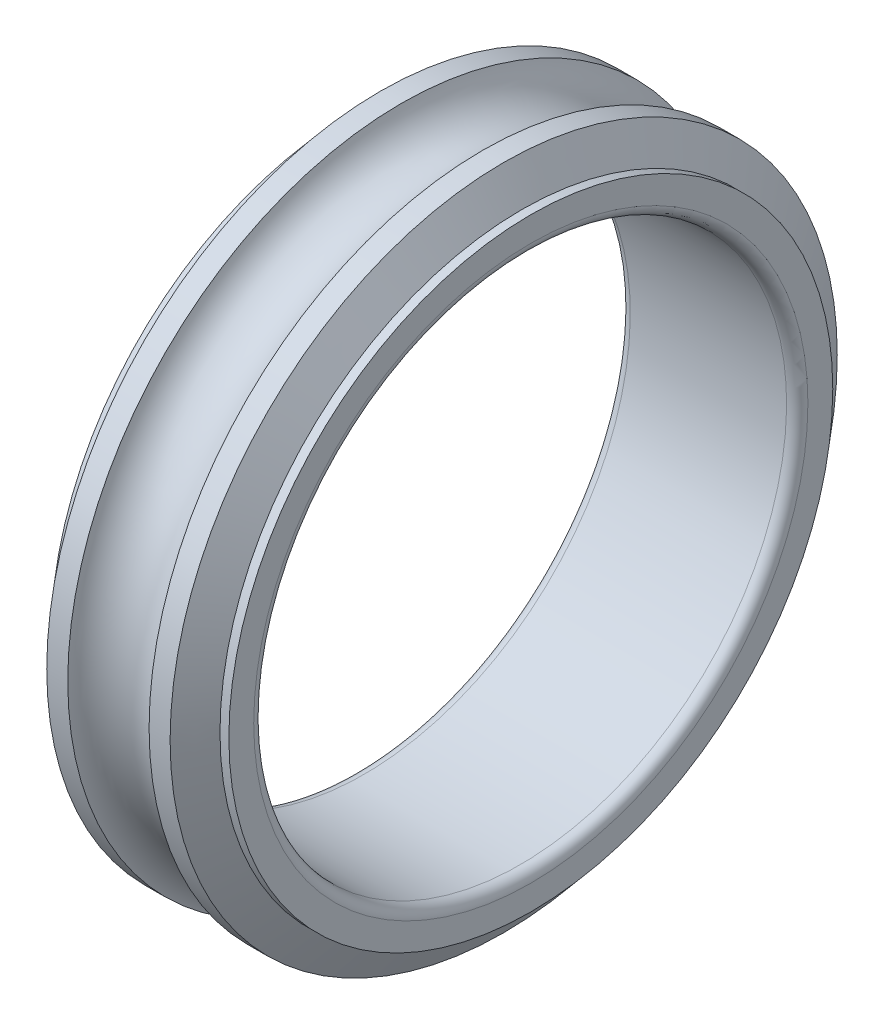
ISO-10303-21;
HEADER;
FILE_DESCRIPTION(('STEP AP214'),'2;1');
FILE_NAME('part.step','',(''),(''),'','','');
FILE_SCHEMA(('AUTOMOTIVE_DESIGN { 1 0 10303 214 1 1 1 1 }'));
ENDSEC;
DATA;
#1=APPLICATION_CONTEXT('core data for automotive mechanical design processes');
#2=APPLICATION_PROTOCOL_DEFINITION('international standard','automotive_design',2000,#1);
#3=PRODUCT_CONTEXT('',#1,'mechanical');
#4=PRODUCT('Part','Part','',(#3));
#5=PRODUCT_RELATED_PRODUCT_CATEGORY('part','',(#4));
#6=PRODUCT_DEFINITION_FORMATION('','',#4);
#7=PRODUCT_DEFINITION_CONTEXT('part definition',#1,'design');
#8=PRODUCT_DEFINITION('design','',#6,#7);
#9=PRODUCT_DEFINITION_SHAPE('','',#8);
#10=(LENGTH_UNIT() NAMED_UNIT(*) SI_UNIT(.MILLI.,.METRE.));
#11=(NAMED_UNIT(*) PLANE_ANGLE_UNIT() SI_UNIT($,.RADIAN.));
#12=(NAMED_UNIT(*) SI_UNIT($,.STERADIAN.) SOLID_ANGLE_UNIT());
#13=UNCERTAINTY_MEASURE_WITH_UNIT(LENGTH_MEASURE(1.E-05),#10,'distance_accuracy_value','');
#14=(GEOMETRIC_REPRESENTATION_CONTEXT(3) GLOBAL_UNCERTAINTY_ASSIGNED_CONTEXT((#13)) GLOBAL_UNIT_ASSIGNED_CONTEXT((#10,
#11,#12)) REPRESENTATION_CONTEXT('',''));
#15=CARTESIAN_POINT('',(0.,0.,0.));
#16=DIRECTION('',(0.,0.,1.));
#17=DIRECTION('',(1.,0.,0.));
#18=AXIS2_PLACEMENT_3D('',#15,#16,#17);
#19=CARTESIAN_POINT('',(2.5,0.,0.));
#20=DIRECTION('',(-1.,0.,0.));
#21=DIRECTION('',(0.,1.,0.));
#22=AXIS2_PLACEMENT_3D('',#19,#20,#21);
#23=CYLINDRICAL_SURFACE('',#22,7.5);
#24=CARTESIAN_POINT('',(4.7,0.,0.));
#25=DIRECTION('',(1.,0.,0.));
#26=DIRECTION('',(0.,1.,0.));
#27=AXIS2_PLACEMENT_3D('',#24,#25,#26);
#28=CIRCLE('',#27,7.5);
#29=CARTESIAN_POINT('',(4.7,7.5,0.));
#30=VERTEX_POINT('',#29);
#31=EDGE_CURVE('E11',#30,#30,#28,.T.);
#32=ORIENTED_EDGE('',*,*,#31,.T.);
#33=EDGE_LOOP('',(#32));
#34=FACE_BOUND('',#33,.T.);
#35=CARTESIAN_POINT('',(0.3,0.,0.));
#36=DIRECTION('',(1.,0.,0.));
#37=DIRECTION('',(0.,1.,0.));
#38=AXIS2_PLACEMENT_3D('',#35,#36,#37);
#39=CIRCLE('',#38,7.5);
#40=CARTESIAN_POINT('',(0.3,7.5,0.));
#41=VERTEX_POINT('',#40);
#42=EDGE_CURVE('E78',#41,#41,#39,.T.);
#43=ORIENTED_EDGE('',*,*,#42,.F.);
#44=EDGE_LOOP('',(#43));
#45=FACE_BOUND('',#44,.T.);
#46=ADVANCED_FACE('F17',(#34,#45),#23,.F.);
#47=CARTESIAN_POINT('',(4.7,0.,0.));
#48=DIRECTION('',(1.,0.,0.));
#49=DIRECTION('',(0.,0.,-1.));
#50=AXIS2_PLACEMENT_3D('',#47,#48,#49);
#51=TOROIDAL_SURFACE('',#50,7.8,0.3);
#52=CARTESIAN_POINT('',(5.,0.,0.));
#53=DIRECTION('',(1.,0.,0.));
#54=DIRECTION('',(0.,1.,0.));
#55=AXIS2_PLACEMENT_3D('',#52,#53,#54);
#56=CIRCLE('',#55,7.8);
#57=CARTESIAN_POINT('',(5.,7.8,0.));
#58=VERTEX_POINT('',#57);
#59=EDGE_CURVE('E27',#58,#58,#56,.T.);
#60=ORIENTED_EDGE('',*,*,#59,.T.);
#61=EDGE_LOOP('',(#60));
#62=FACE_BOUND('',#61,.T.);
#63=ORIENTED_EDGE('',*,*,#31,.F.);
#64=EDGE_LOOP('',(#63));
#65=FACE_BOUND('',#64,.T.);
#66=ADVANCED_FACE('F110',(#62,#65),#51,.T.);
#67=CARTESIAN_POINT('',(5.,8.15,0.));
#68=DIRECTION('',(1.,0.,0.));
#69=DIRECTION('',(0.,1.,0.));
#70=AXIS2_PLACEMENT_3D('',#67,#68,#69);
#71=PLANE('',#70);
#72=CARTESIAN_POINT('',(5.,0.,0.));
#73=DIRECTION('',(1.,0.,0.));
#74=DIRECTION('',(0.,1.,0.));
#75=AXIS2_PLACEMENT_3D('',#72,#73,#74);
#76=CIRCLE('',#75,8.5);
#77=CARTESIAN_POINT('',(5.,8.5,0.));
#78=VERTEX_POINT('',#77);
#79=EDGE_CURVE('E86',#78,#78,#76,.T.);
#80=ORIENTED_EDGE('',*,*,#79,.T.);
#81=EDGE_LOOP('',(#80));
#82=FACE_BOUND('',#81,.T.);
#83=ORIENTED_EDGE('',*,*,#59,.F.);
#84=EDGE_LOOP('',(#83));
#85=FACE_BOUND('',#84,.T.);
#86=ADVANCED_FACE('F19',(#82,#85),#71,.T.);
#87=CARTESIAN_POINT('',(4.875,0.,0.));
#88=DIRECTION('',(-1.,0.,0.));
#89=DIRECTION('',(0.,1.,0.));
#90=AXIS2_PLACEMENT_3D('',#87,#88,#89);
#91=CYLINDRICAL_SURFACE('',#90,8.5);
#92=CARTESIAN_POINT('',(4.75,0.,0.));
#93=DIRECTION('',(1.,0.,0.));
#94=DIRECTION('',(0.,1.,0.));
#95=AXIS2_PLACEMENT_3D('',#92,#93,#94);
#96=CIRCLE('',#95,8.5);
#97=CARTESIAN_POINT('',(4.75,8.5,0.));
#98=VERTEX_POINT('',#97);
#99=EDGE_CURVE('E84',#98,#98,#96,.T.);
#100=ORIENTED_EDGE('',*,*,#99,.T.);
#101=EDGE_LOOP('',(#100));
#102=FACE_BOUND('',#101,.T.);
#103=ORIENTED_EDGE('',*,*,#79,.F.);
#104=EDGE_LOOP('',(#103));
#105=FACE_BOUND('',#104,.T.);
#106=ADVANCED_FACE('F138',(#102,#105),#91,.T.);
#107=CARTESIAN_POINT('',(4.49307913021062,0.,0.));
#108=DIRECTION('',(-1.,0.,0.));
#109=DIRECTION('',(0.,1.,0.));
#110=AXIS2_PLACEMENT_3D('',#107,#108,#109);
#111=CONICAL_SURFACE('',#110,8.945,1.0471975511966);
#112=CARTESIAN_POINT('',(4.23615826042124,0.,0.));
#113=DIRECTION('',(1.,0.,0.));
#114=DIRECTION('',(0.,1.,0.));
#115=AXIS2_PLACEMENT_3D('',#112,#113,#114);
#116=CIRCLE('',#115,9.39);
#117=CARTESIAN_POINT('',(4.23615826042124,9.39,0.));
#118=VERTEX_POINT('',#117);
#119=EDGE_CURVE('E58',#118,#118,#116,.T.);
#120=ORIENTED_EDGE('',*,*,#119,.T.);
#121=EDGE_LOOP('',(#120));
#122=FACE_BOUND('',#121,.T.);
#123=ORIENTED_EDGE('',*,*,#99,.F.);
#124=EDGE_LOOP('',(#123));
#125=FACE_BOUND('',#124,.T.);
#126=ADVANCED_FACE('F122',(#122,#125),#111,.T.);
#127=CARTESIAN_POINT('',(3.94044265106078,0.,0.));
#128=DIRECTION('',(-1.,0.,0.));
#129=DIRECTION('',(0.,1.,0.));
#130=AXIS2_PLACEMENT_3D('',#127,#128,#129);
#131=CYLINDRICAL_SURFACE('',#130,9.39);
#132=CARTESIAN_POINT('',(3.64472704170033,0.,0.));
#133=DIRECTION('',(1.,0.,0.));
#134=DIRECTION('',(0.,1.,0.));
#135=AXIS2_PLACEMENT_3D('',#132,#133,#134);
#136=CIRCLE('',#135,9.39);
#137=CARTESIAN_POINT('',(3.64472704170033,9.39,0.));
#138=VERTEX_POINT('',#137);
#139=EDGE_CURVE('E54',#138,#138,#136,.T.);
#140=ORIENTED_EDGE('',*,*,#139,.T.);
#141=EDGE_LOOP('',(#140));
#142=FACE_BOUND('',#141,.T.);
#143=ORIENTED_EDGE('',*,*,#119,.F.);
#144=EDGE_LOOP('',(#143));
#145=FACE_BOUND('',#144,.T.);
#146=ADVANCED_FACE('F118',(#142,#145),#131,.T.);
#147=CARTESIAN_POINT('',(2.5,0.,0.));
#148=DIRECTION('',(1.,0.,0.));
#149=DIRECTION('',(0.,0.,-1.));
#150=AXIS2_PLACEMENT_3D('',#147,#148,#149);
#151=TOROIDAL_SURFACE('',#150,9.75,1.2);
#152=CARTESIAN_POINT('',(1.35527295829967,0.,0.));
#153=DIRECTION('',(1.,0.,0.));
#154=DIRECTION('',(0.,1.,0.));
#155=AXIS2_PLACEMENT_3D('',#152,#153,#154);
#156=CIRCLE('',#155,9.39);
#157=CARTESIAN_POINT('',(1.35527295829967,9.39,0.));
#158=VERTEX_POINT('',#157);
#159=EDGE_CURVE('E77',#158,#158,#156,.T.);
#160=ORIENTED_EDGE('',*,*,#159,.T.);
#161=EDGE_LOOP('',(#160));
#162=FACE_BOUND('',#161,.T.);
#163=ORIENTED_EDGE('',*,*,#139,.F.);
#164=EDGE_LOOP('',(#163));
#165=FACE_BOUND('',#164,.T.);
#166=ADVANCED_FACE('F121',(#162,#165),#151,.F.);
#167=CARTESIAN_POINT('',(1.05955734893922,0.,0.));
#168=DIRECTION('',(-1.,0.,0.));
#169=DIRECTION('',(0.,1.,0.));
#170=AXIS2_PLACEMENT_3D('',#167,#168,#169);
#171=CYLINDRICAL_SURFACE('',#170,9.39);
#172=CARTESIAN_POINT('',(0.763841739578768,0.,0.));
#173=DIRECTION('',(1.,0.,0.));
#174=DIRECTION('',(0.,1.,0.));
#175=AXIS2_PLACEMENT_3D('',#172,#173,#174);
#176=CIRCLE('',#175,9.39);
#177=CARTESIAN_POINT('',(0.763841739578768,9.39,0.));
#178=VERTEX_POINT('',#177);
#179=EDGE_CURVE('E21',#178,#178,#176,.T.);
#180=ORIENTED_EDGE('',*,*,#179,.T.);
#181=EDGE_LOOP('',(#180));
#182=FACE_BOUND('',#181,.T.);
#183=ORIENTED_EDGE('',*,*,#159,.F.);
#184=EDGE_LOOP('',(#183));
#185=FACE_BOUND('',#184,.T.);
#186=ADVANCED_FACE('F123',(#182,#185),#171,.T.);
#187=CARTESIAN_POINT('',(0.506920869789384,0.,0.));
#188=DIRECTION('',(1.,0.,0.));
#189=DIRECTION('',(0.,1.,0.));
#190=AXIS2_PLACEMENT_3D('',#187,#188,#189);
#191=CONICAL_SURFACE('',#190,8.945,1.0471975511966);
#192=CARTESIAN_POINT('',(0.25,0.,0.));
#193=DIRECTION('',(1.,0.,0.));
#194=DIRECTION('',(0.,1.,0.));
#195=AXIS2_PLACEMENT_3D('',#192,#193,#194);
#196=CIRCLE('',#195,8.5);
#197=CARTESIAN_POINT('',(0.25,8.5,0.));
#198=VERTEX_POINT('',#197);
#199=EDGE_CURVE('E71',#198,#198,#196,.T.);
#200=ORIENTED_EDGE('',*,*,#199,.T.);
#201=EDGE_LOOP('',(#200));
#202=FACE_BOUND('',#201,.T.);
#203=ORIENTED_EDGE('',*,*,#179,.F.);
#204=EDGE_LOOP('',(#203));
#205=FACE_BOUND('',#204,.T.);
#206=ADVANCED_FACE('F72',(#202,#205),#191,.T.);
#207=CARTESIAN_POINT('',(0.125,0.,0.));
#208=DIRECTION('',(-1.,0.,0.));
#209=DIRECTION('',(0.,1.,0.));
#210=AXIS2_PLACEMENT_3D('',#207,#208,#209);
#211=CYLINDRICAL_SURFACE('',#210,8.5);
#212=CARTESIAN_POINT('',(0.,0.,0.));
#213=DIRECTION('',(1.,0.,0.));
#214=DIRECTION('',(0.,1.,0.));
#215=AXIS2_PLACEMENT_3D('',#212,#213,#214);
#216=CIRCLE('',#215,8.5);
#217=CARTESIAN_POINT('',(0.,8.5,0.));
#218=VERTEX_POINT('',#217);
#219=EDGE_CURVE('E75',#218,#218,#216,.T.);
#220=ORIENTED_EDGE('',*,*,#219,.T.);
#221=EDGE_LOOP('',(#220));
#222=FACE_BOUND('',#221,.T.);
#223=ORIENTED_EDGE('',*,*,#199,.F.);
#224=EDGE_LOOP('',(#223));
#225=FACE_BOUND('',#224,.T.);
#226=ADVANCED_FACE('F105',(#222,#225),#211,.T.);
#227=CARTESIAN_POINT('',(0.,8.15,0.));
#228=DIRECTION('',(-1.,0.,0.));
#229=DIRECTION('',(0.,-1.,0.));
#230=AXIS2_PLACEMENT_3D('',#227,#228,#229);
#231=PLANE('',#230);
#232=CARTESIAN_POINT('',(0.,0.,0.));
#233=DIRECTION('',(1.,0.,0.));
#234=DIRECTION('',(0.,1.,0.));
#235=AXIS2_PLACEMENT_3D('',#232,#233,#234);
#236=CIRCLE('',#235,7.8);
#237=CARTESIAN_POINT('',(0.,7.8,0.));
#238=VERTEX_POINT('',#237);
#239=EDGE_CURVE('E90',#238,#238,#236,.T.);
#240=ORIENTED_EDGE('',*,*,#239,.T.);
#241=EDGE_LOOP('',(#240));
#242=FACE_BOUND('',#241,.T.);
#243=ORIENTED_EDGE('',*,*,#219,.F.);
#244=EDGE_LOOP('',(#243));
#245=FACE_BOUND('',#244,.T.);
#246=ADVANCED_FACE('F95',(#242,#245),#231,.T.);
#247=CARTESIAN_POINT('',(0.3,0.,0.));
#248=DIRECTION('',(1.,0.,0.));
#249=DIRECTION('',(0.,0.,-1.));
#250=AXIS2_PLACEMENT_3D('',#247,#248,#249);
#251=TOROIDAL_SURFACE('',#250,7.8,0.3);
#252=ORIENTED_EDGE('',*,*,#42,.T.);
#253=EDGE_LOOP('',(#252));
#254=FACE_BOUND('',#253,.T.);
#255=ORIENTED_EDGE('',*,*,#239,.F.);
#256=EDGE_LOOP('',(#255));
#257=FACE_BOUND('',#256,.T.);
#258=ADVANCED_FACE('F98',(#254,#257),#251,.T.);
#259=CLOSED_SHELL('',(#46,#66,#86,#106,#126,#146,#166,#186,#206,#226,#246,#258));
#260=MANIFOLD_SOLID_BREP('B1',#259);
#261=ADVANCED_BREP_SHAPE_REPRESENTATION('',(#18,#260),#14);
#262=SHAPE_DEFINITION_REPRESENTATION(#9,#261);
ENDSEC;
END-ISO-10303-21;
